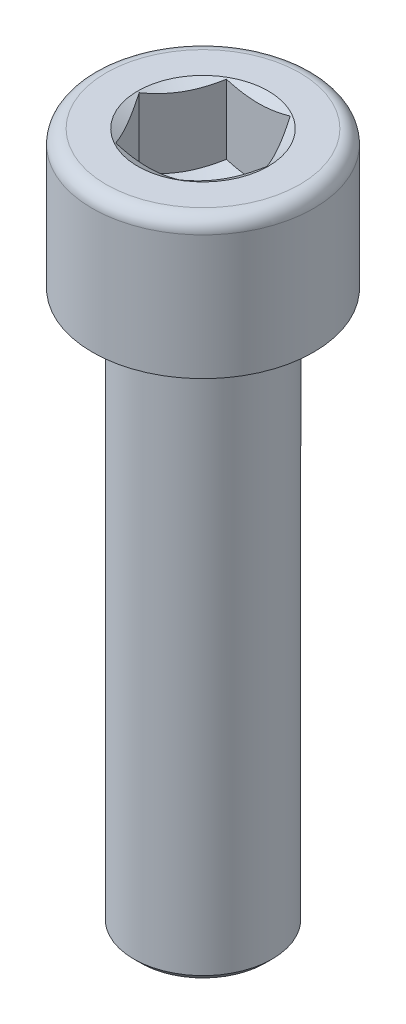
from build123d import *

# Parameters (mm, degrees)
SKIZZE2_R             = 8
SCHRAUBENKOPF_DEPTH   = 10
SKIZZE3_R             = 5
SCHRAUBENSCHAFT_DEPTH = 40
SKIZZE5_R             = 4.75
INNENSECHSKANT_DEPTH  = 10
FASE_0_5X45_SIZE      = 0.5
FILLET_R_0_4_R        = 0.4
FILLET_R_1_R          = 1


with BuildPart() as part:
    # Skizze2 → Schraubenkopf (new body)
    with BuildSketch(Plane(origin=(0, 0, 0), x_dir=(1, 0, 0), z_dir=(0, 1, 0))):
        with Locations(Location((0, 0, 0), (0, 0, 270))):
            Circle(SKIZZE2_R)
    extrude(amount=SCHRAUBENKOPF_DEPTH)

    # Skizze3 → Schraubenschaft (add)
    with BuildSketch(Plane.XZ):
        with Locations(Location((0, 0, 0), (0, 0, 90))):
            Circle(SKIZZE3_R)
    extrude(amount=SCHRAUBENSCHAFT_DEPTH)

    # Skizze4 → Kegelform Innensechskant (revolve, cut)
    with BuildSketch(Plane.XY, mode=Mode.PRIVATE) as kegelform_innensechskant_sk:
        Polygon((4.75, 10), (4.75, 5), (0, 2.257586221), (0, 10), align=None)
    revolve(kegelform_innensechskant_sk.sketch.rotate(Axis((0, 7.065718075, 0), (0, -1, 0)), 90), axis=Axis((0, 7.065718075, 0), (0, -1, 0)), mode=Mode.SUBTRACT)

    # Skizze5 → Innensechskant (add)
    with BuildSketch(Plane(origin=(0, 0, 0), x_dir=(1, 0, 0), z_dir=(0, 1, 0))):
        Circle(SKIZZE5_R)
        Polygon((2.309401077, -4), (4.618802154, 0), (2.309401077, 4), (-2.309401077, 4), (-4.618802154, 0), (-2.309401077, -4), align=None, mode=Mode.SUBTRACT)
    extrude(amount=INNENSECHSKANT_DEPTH)

    # Skizze6 → Fase Innensechskant (revolve, cut)
    with BuildSketch(Plane.XY, mode=Mode.PRIVATE) as fase_innensechskant_sk:
        Polygon((3.718802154, 10), (4.718802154, 10), (3.718802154, 9.422649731), align=None)
    revolve(fase_innensechskant_sk.sketch.rotate(Axis((0, 0, 0), (0, 1, 0)), 240.000000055), axis=Axis((0, 0, 0), (0, 1, 0)), mode=Mode.SUBTRACT)

    # Fase 0_5x45
    fase_0_5x45_edges = [part.edges().sort_by_distance(p)[0] for p in [
        (0, -40, -5),
    ]]
    chamfer(fase_0_5x45_edges, length=FASE_0_5X45_SIZE)

    # Fillet R 0_4
    fillet_r_0_4_edges = [part.edges().sort_by_distance(p)[0] for p in [
        (0, 0, -5),
    ]]
    fillet(fillet_r_0_4_edges, radius=FILLET_R_0_4_R)

    # Fillet R 1
    fillet_r_1_edges = [part.edges().sort_by_distance(p)[0] for p in [
        (0, 10, -8),
    ]]
    fillet(fillet_r_1_edges, radius=FILLET_R_1_R)


solid = part.part
